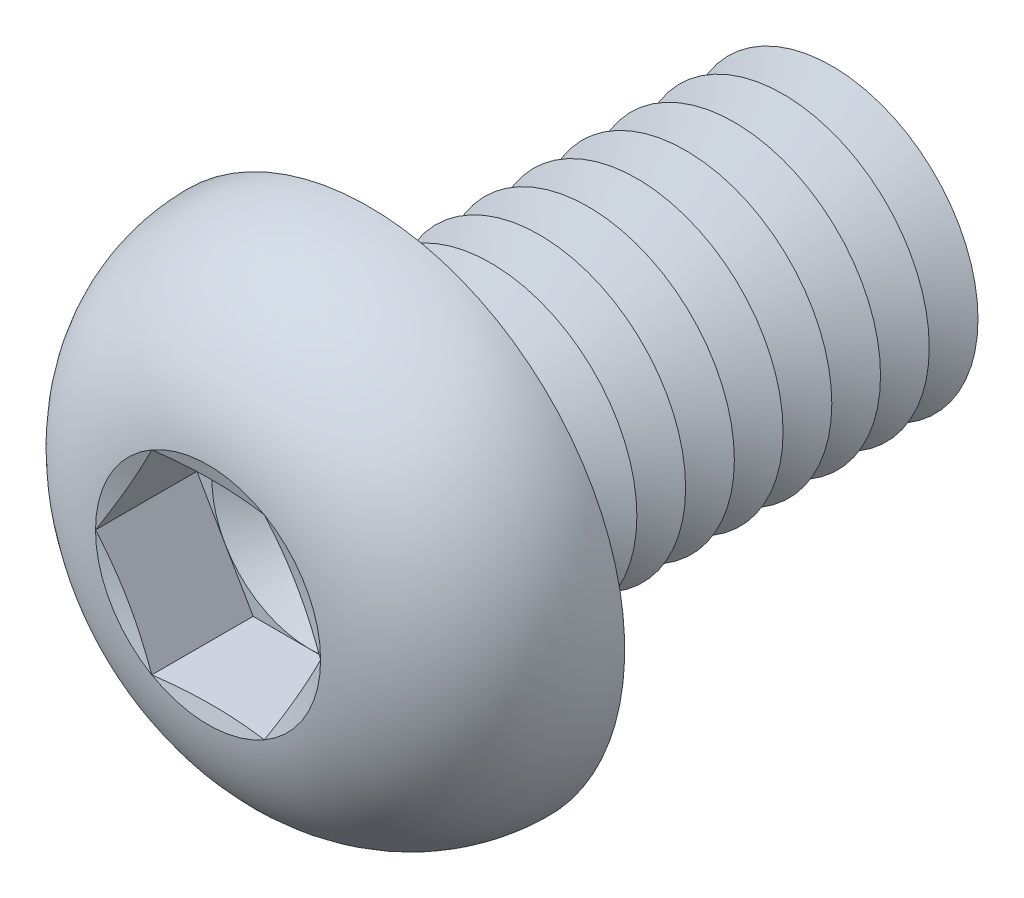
from build123d import *

# Parameters (mm, degrees)
FILLET1_R          = 0.5
LPATTERN1_COUNT    = 10
LPATTERN1_PITCH    = 1
CUT_EXTRUDE1_DEPTH = 2.08


with BuildPart() as part:
    # Sketch1 → Revolve1 (revolve)
    with BuildSketch(Plane(origin=(0, 0, 0), x_dir=(0, 0, -1), z_dir=(1, 0, 0)), mode=Mode.PRIVATE) as revolve1_sk:
        with BuildLine():
            Line((0, 3), (0, 5.25))
            ThreePointArc((0, 5.25), (-2.210041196, 4.408189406), (-3.3, 2.3094))
            Line((-3.3, 2.3094), (-2.990599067, 1.1547))
            Line((-2.990599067, 1.1547), (-3.3, 1.1547))
            Line((-3.3, 1.1547), (-3.3, 0))
            Line((-3.3, 0), (10, 0))
            Line((10, 0), (10, 3))
            Line((10, 3), (0, 3))
        make_face()
    revolve(revolve1_sk.sketch.rotate(Axis((0, 0, -10), (0, 0, 1)), 90), axis=Axis((0, 0, -10), (0, 0, 1)))

    # Fillet1
    fillet1_edges = [part.edges().sort_by_distance(p)[0] for p in [
        (3, 0, 0),
    ]]
    fillet(fillet1_edges, radius=FILLET1_R)

    # Sketch2 → Cut-Revolve1 (revolve, cut)
    with BuildSketch(Plane(origin=(0, 0, 0), x_dir=(0, 0, -1), z_dir=(1, 0, 0)), mode=Mode.PRIVATE) as cut_revolve1_sk:
        Polygon((9.5, 3), (10.5, 3), (10, 2.133974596), align=None)
    cut_revolve1 = revolve(cut_revolve1_sk.sketch.rotate(Axis((0, 0, -10), (0, 0, -1)), 270), axis=Axis((0, 0, -10), (0, 0, -1)), mode=Mode.SUBTRACT)

    # LPattern1: Cut-Revolve1 ×10
    with Locations(*[(0, 0, i * LPATTERN1_PITCH) for i in range(1, LPATTERN1_COUNT)]):
        add(cut_revolve1, mode=Mode.SUBTRACT)

    # Sketch3 → Cut-Extrude1 (cut)
    with BuildSketch(Plane.XY.offset(3.3)):
        Polygon((1.1547, 1.999999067), (-1.1547, 1.999999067), (-2.3094, 0), (-1.1547, -1.999999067), (1.1547, -1.999999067), (2.3094, 0), align=None)
    extrude(amount=-CUT_EXTRUDE1_DEPTH, mode=Mode.SUBTRACT)

    # Cut-Extrude2 cone 1 section (on through the dimple's axis) → Cut-Extrude2 (revolve, cut)
    with BuildSketch(Plane(origin=(0, 0, 1.22), x_dir=(0, -1, 0), z_dir=(1, 0, 0))):
        Polygon((0, 0), (1.999999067, 0), (0, 1.1547), align=None)
    revolve(axis=Axis((0, 0, 1.22), (0, 0, -1)), mode=Mode.SUBTRACT)


solid = part.part
